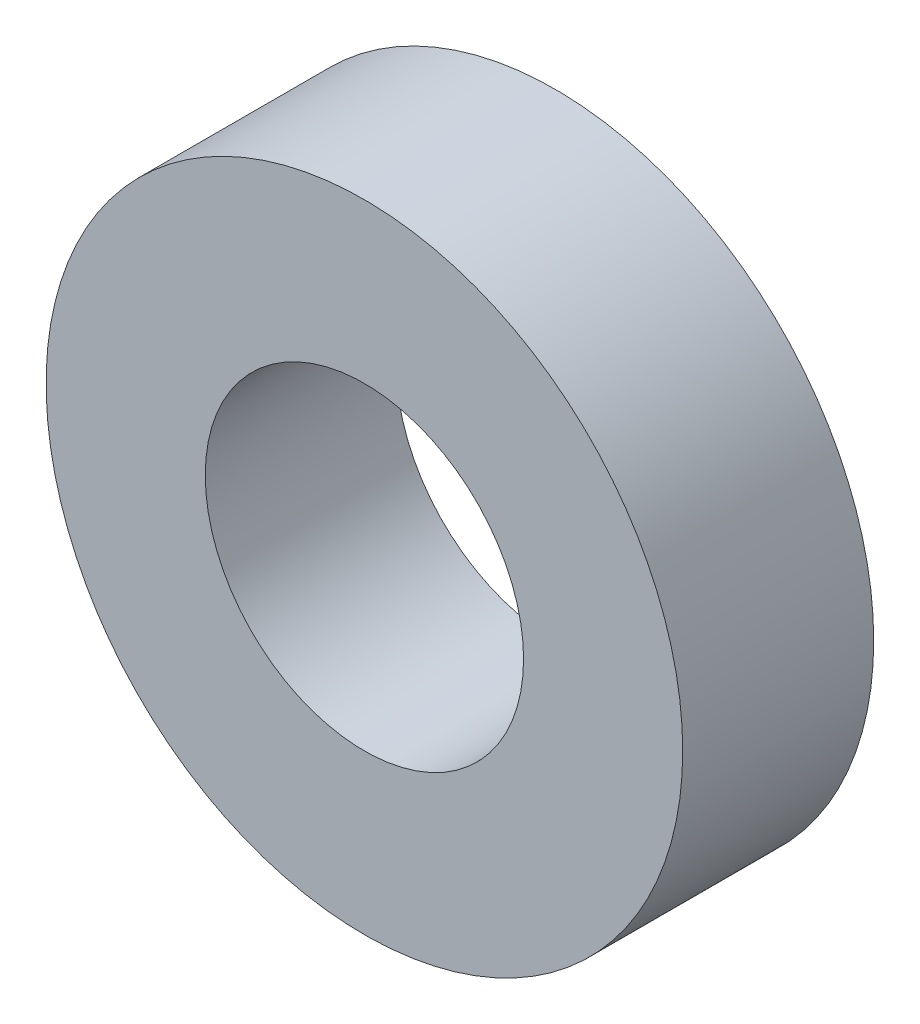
from build123d import *

# Parameters (mm, degrees)
SKETCH1_R      = 10
SKETCH1_R_2    = 5
EXTRUDE1_DEPTH = 6


with BuildPart() as part:
    # Sketch1 → Extrude1 (new body)
    with BuildSketch(Plane.XY):
        Circle(SKETCH1_R)
        Circle(SKETCH1_R_2, mode=Mode.SUBTRACT)
    extrude(amount=EXTRUDE1_DEPTH)


solid = part.part
